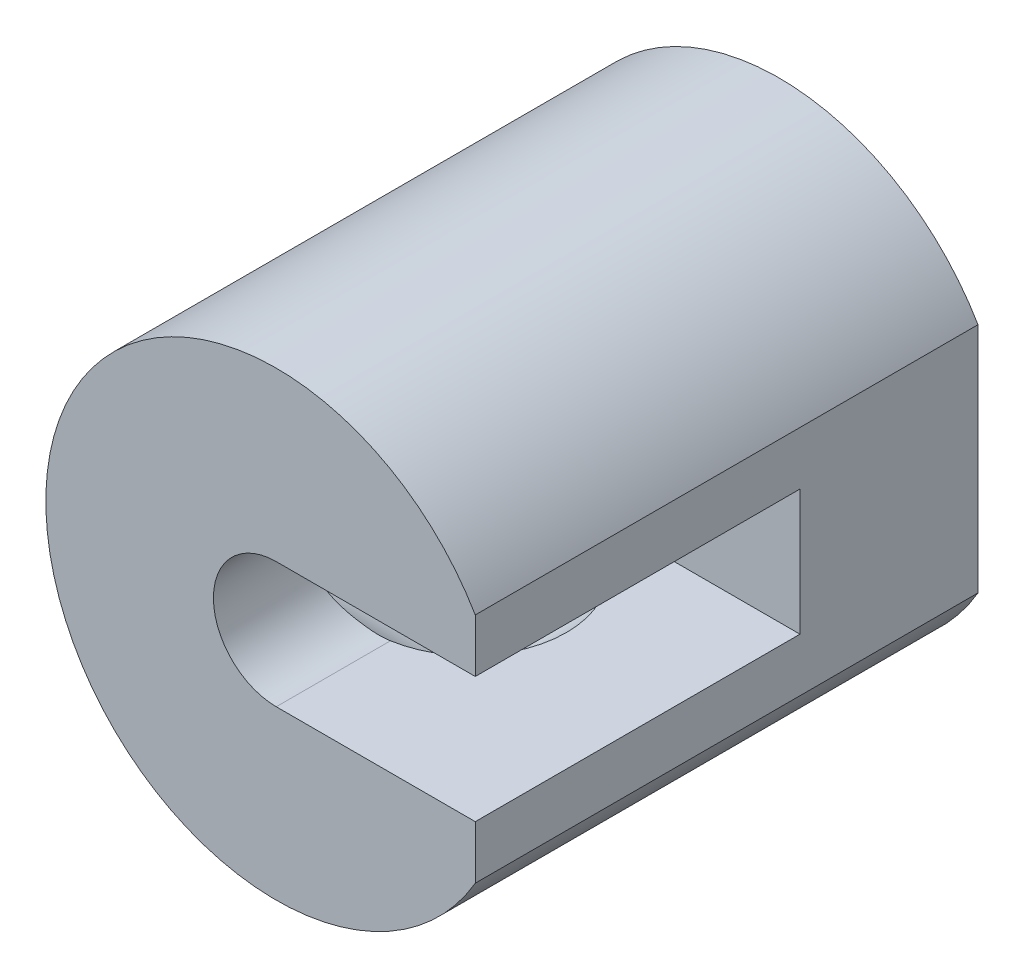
ISO-10303-21;
HEADER;
FILE_DESCRIPTION(('STEP AP214'),'2;1');
FILE_NAME('part.step','',(''),(''),'','','');
FILE_SCHEMA(('AUTOMOTIVE_DESIGN { 1 0 10303 214 1 1 1 1 }'));
ENDSEC;
DATA;
#1=APPLICATION_CONTEXT('core data for automotive mechanical design processes');
#2=APPLICATION_PROTOCOL_DEFINITION('international standard','automotive_design',2000,#1);
#3=PRODUCT_CONTEXT('',#1,'mechanical');
#4=PRODUCT('Part','Part','',(#3));
#5=PRODUCT_RELATED_PRODUCT_CATEGORY('part','',(#4));
#6=PRODUCT_DEFINITION_FORMATION('','',#4);
#7=PRODUCT_DEFINITION_CONTEXT('part definition',#1,'design');
#8=PRODUCT_DEFINITION('design','',#6,#7);
#9=PRODUCT_DEFINITION_SHAPE('','',#8);
#10=(LENGTH_UNIT() NAMED_UNIT(*) SI_UNIT(.MILLI.,.METRE.));
#11=(NAMED_UNIT(*) PLANE_ANGLE_UNIT() SI_UNIT($,.RADIAN.));
#12=(NAMED_UNIT(*) SI_UNIT($,.STERADIAN.) SOLID_ANGLE_UNIT());
#13=UNCERTAINTY_MEASURE_WITH_UNIT(LENGTH_MEASURE(1.E-05),#10,'distance_accuracy_value','');
#14=(GEOMETRIC_REPRESENTATION_CONTEXT(3) GLOBAL_UNCERTAINTY_ASSIGNED_CONTEXT((#13)) GLOBAL_UNIT_ASSIGNED_CONTEXT((#10,
#11,#12)) REPRESENTATION_CONTEXT('',''));
#15=CARTESIAN_POINT('',(0.,0.,0.));
#16=DIRECTION('',(0.,0.,1.));
#17=DIRECTION('',(1.,0.,0.));
#18=AXIS2_PLACEMENT_3D('',#15,#16,#17);
#19=CARTESIAN_POINT('',(4.74999999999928,0.,14.));
#20=DIRECTION('',(1.,0.,0.));
#21=DIRECTION('',(0.,1.,0.));
#22=AXIS2_PLACEMENT_3D('',#19,#20,#21);
#23=CYLINDRICAL_SURFACE('',#22,5.49999999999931);
#24=CARTESIAN_POINT('',(-9.52627944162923,5.49999999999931,14.));
#25=CARTESIAN_POINT('',(-9.52628026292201,5.49999938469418,13.856635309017));
#26=CARTESIAN_POINT('',(-9.52952683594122,5.49438702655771,13.7132581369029));
#27=CARTESIAN_POINT('',(-9.54239256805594,5.4720112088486,13.4276087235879));
#28=CARTESIAN_POINT('',(-9.55201469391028,5.45524255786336,13.2853370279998));
#29=CARTESIAN_POINT('',(-9.5772912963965,5.4107434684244,13.0028371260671));
#30=CARTESIAN_POINT('',(-9.59295523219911,5.38299583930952,12.8626124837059));
#31=CARTESIAN_POINT('',(-9.62975989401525,5.31687440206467,12.5853732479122));
#32=CARTESIAN_POINT('',(-9.65090300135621,5.27849597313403,12.4483600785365));
#33=CARTESIAN_POINT('',(-9.69782007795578,5.19179128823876,12.179239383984));
#34=CARTESIAN_POINT('',(-9.72356646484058,5.14352404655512,12.0471080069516));
#35=CARTESIAN_POINT('',(-9.77898767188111,5.03735912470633,11.7876047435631));
#36=CARTESIAN_POINT('',(-9.80866401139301,4.97945771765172,11.6602347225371));
#37=CARTESIAN_POINT('',(-9.90232154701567,4.79202654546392,11.2863099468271));
#38=CARTESIAN_POINT('',(-9.97097829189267,4.6486869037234,11.0476858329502));
#39=CARTESIAN_POINT('',(-10.1198329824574,4.31565962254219,10.5772818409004));
#40=CARTESIAN_POINT('',(-10.2005157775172,4.12312437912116,10.3476897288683));
#41=CARTESIAN_POINT('',(-10.3604667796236,3.70285774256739,9.92223888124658));
#42=CARTESIAN_POINT('',(-10.4397342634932,3.4751088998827,9.72639697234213));
#43=CARTESIAN_POINT('',(-10.5543291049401,3.10236472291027,9.45564941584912));
#44=CARTESIAN_POINT('',(-10.5929291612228,2.96821996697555,9.36689512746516));
#45=CARTESIAN_POINT('',(-10.6664816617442,2.69194359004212,9.20110887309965));
#46=CARTESIAN_POINT('',(-10.7014355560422,2.54981517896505,9.12407224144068));
#47=CARTESIAN_POINT('',(-10.7666847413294,2.25849127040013,8.98248603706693));
#48=CARTESIAN_POINT('',(-10.796981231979,2.10929760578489,8.91793324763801));
#49=CARTESIAN_POINT('',(-10.8520196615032,1.80487667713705,8.80202591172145));
#50=CARTESIAN_POINT('',(-10.8767621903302,1.64965005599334,8.75066996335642));
#51=CARTESIAN_POINT('',(-10.9183839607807,1.34563480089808,8.6649829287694));
#52=CARTESIAN_POINT('',(-10.9356972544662,1.19717331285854,8.62970087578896));
#53=CARTESIAN_POINT('',(-10.9643772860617,0.89728010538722,8.57153693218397));
#54=CARTESIAN_POINT('',(-10.9757446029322,0.745848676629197,8.54865383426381));
#55=CARTESIAN_POINT('',(-10.9921999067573,0.441338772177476,8.51559809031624));
#56=CARTESIAN_POINT('',(-10.9972909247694,0.288261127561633,8.50541930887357));
#57=CARTESIAN_POINT('',(-11.0010524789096,-0.0182842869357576,8.49789425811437));
#58=CARTESIAN_POINT('',(-10.9997234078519,-0.171752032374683,8.50054720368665));
#59=CARTESIAN_POINT('',(-10.9910819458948,-0.464373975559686,8.51785357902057));
#60=CARTESIAN_POINT('',(-10.9843017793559,-0.603608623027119,8.53143964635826));
#61=CARTESIAN_POINT('',(-10.9655930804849,-0.880344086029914,8.56911613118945));
#62=CARTESIAN_POINT('',(-10.9536629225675,-1.017844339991,8.59320986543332));
#63=CARTESIAN_POINT('',(-10.9249447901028,-1.29008212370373,8.65162972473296));
#64=CARTESIAN_POINT('',(-10.9081584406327,-1.42482056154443,8.68595242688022));
#65=CARTESIAN_POINT('',(-10.8701111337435,-1.69078120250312,8.76449660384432));
#66=CARTESIAN_POINT('',(-10.848848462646,-1.82200203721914,8.80872187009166));
#67=CARTESIAN_POINT('',(-10.802015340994,-2.08185496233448,8.90731470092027));
#68=CARTESIAN_POINT('',(-10.7763909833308,-2.21042880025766,8.96181023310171));
#69=CARTESIAN_POINT('',(-10.7216085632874,-2.46247345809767,9.08007827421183));
#70=CARTESIAN_POINT('',(-10.6924492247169,-2.58594241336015,9.14385413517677));
#71=CARTESIAN_POINT('',(-10.6005932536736,-2.94774083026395,9.34838977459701));
#72=CARTESIAN_POINT('',(-10.5334891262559,-3.17761932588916,9.50241788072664));
#73=CARTESIAN_POINT('',(-10.3864376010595,-3.63098933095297,9.85793205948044));
#74=CARTESIAN_POINT('',(-10.3058757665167,-3.85182303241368,10.0625279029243));
#75=CARTESIAN_POINT('',(-10.1449786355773,-4.25758842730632,10.5052822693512));
#76=CARTESIAN_POINT('',(-10.0646435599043,-4.44249249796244,10.7434663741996));
#77=CARTESIAN_POINT('',(-9.94829980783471,-4.69475077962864,11.1303134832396));
#78=CARTESIAN_POINT('',(-9.90912969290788,-4.77664146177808,11.2687561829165));
#79=CARTESIAN_POINT('',(-9.834566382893,-4.92832970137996,11.5530651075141));
#80=CARTESIAN_POINT('',(-9.79917159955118,-4.99813235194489,11.6989281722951));
#81=CARTESIAN_POINT('',(-9.73346692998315,-5.12491225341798,11.9971238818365));
#82=CARTESIAN_POINT('',(-9.70315396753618,-5.18189727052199,12.1494525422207));
#83=CARTESIAN_POINT('',(-9.64881329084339,-5.28239263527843,12.4595834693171));
#84=CARTESIAN_POINT('',(-9.62478471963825,-5.32590482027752,12.6173849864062));
#85=CARTESIAN_POINT('',(-9.58568788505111,-5.39593052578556,12.9244826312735));
#86=CARTESIAN_POINT('',(-9.57006086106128,-5.42351706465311,13.0734631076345));
#87=CARTESIAN_POINT('',(-9.54567038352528,-5.46633229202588,13.3737390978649));
#88=CARTESIAN_POINT('',(-9.53690608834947,-5.48156249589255,13.5250343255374));
#89=CARTESIAN_POINT('',(-9.52661622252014,-5.49942639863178,13.8285270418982));
#90=CARTESIAN_POINT('',(-9.52508651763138,-5.50206729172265,13.9807239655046));
#91=CARTESIAN_POINT('',(-9.52932114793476,-5.49472990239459,14.2847029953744));
#92=CARTESIAN_POINT('',(-9.53508499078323,-5.48475247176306,14.4364851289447));
#93=CARTESIAN_POINT('',(-9.55263655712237,-5.45411820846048,14.721696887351));
#94=CARTESIAN_POINT('',(-9.56369369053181,-5.43475369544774,14.8553123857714));
#95=CARTESIAN_POINT('',(-9.59101548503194,-5.38638840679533,15.1202593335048));
#96=CARTESIAN_POINT('',(-9.60728175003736,-5.35738466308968,15.2515900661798));
#97=CARTESIAN_POINT('',(-9.6631656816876,-5.25635327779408,15.6408810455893));
#98=CARTESIAN_POINT('',(-9.70988100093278,-5.17028506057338,15.8943257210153));
#99=CARTESIAN_POINT('',(-9.81949365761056,-4.95905569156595,16.3948025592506));
#100=CARTESIAN_POINT('',(-9.88304025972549,-4.83226856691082,16.6409940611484));
#101=CARTESIAN_POINT('',(-10.0185866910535,-4.54457763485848,17.110071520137));
#102=CARTESIAN_POINT('',(-10.0905908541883,-4.38365630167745,17.33294541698));
#103=CARTESIAN_POINT('',(-10.245837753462,-4.00861671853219,17.7783805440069));
#104=CARTESIAN_POINT('',(-10.3293530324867,-3.79034975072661,17.9973609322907));
#105=CARTESIAN_POINT('',(-10.4903919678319,-3.31867395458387,18.3967907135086));
#106=CARTESIAN_POINT('',(-10.5679135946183,-3.06525330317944,18.5772270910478));
#107=CARTESIAN_POINT('',(-10.6746136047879,-2.65951482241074,18.8169104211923));
#108=CARTESIAN_POINT('',(-10.7089721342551,-2.51794147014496,18.8924283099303));
#109=CARTESIAN_POINT('',(-10.7730448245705,-2.22789327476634,19.0311321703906));
#110=CARTESIAN_POINT('',(-10.8027610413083,-2.07942152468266,19.0943236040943));
#111=CARTESIAN_POINT('',(-10.856658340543,-1.77668429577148,19.2076396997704));
#112=CARTESIAN_POINT('',(-10.8808420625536,-1.62242162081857,19.257770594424));
#113=CARTESIAN_POINT('',(-10.9229459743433,-1.30927195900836,19.3443599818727));
#114=CARTESIAN_POINT('',(-10.9408669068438,-1.15038552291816,19.3808200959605));
#115=CARTESIAN_POINT('',(-10.968539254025,-0.844141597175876,19.4368545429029));
#116=CARTESIAN_POINT('',(-10.9788895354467,-0.697064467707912,19.457671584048));
#117=CARTESIAN_POINT('',(-10.9936692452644,-0.401416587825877,19.4873427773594));
#118=CARTESIAN_POINT('',(-10.9980991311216,-0.252845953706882,19.496197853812));
#119=CARTESIAN_POINT('',(-11.0009146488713,0.0445367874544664,19.5018295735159));
#120=CARTESIAN_POINT('',(-10.9993020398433,0.193348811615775,19.4986097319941));
#121=CARTESIAN_POINT('',(-10.9900814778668,0.490034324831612,19.4801419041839));
#122=CARTESIAN_POINT('',(-10.9824736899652,0.637907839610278,19.4648942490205));
#123=CARTESIAN_POINT('',(-10.9621702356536,0.921802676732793,19.423971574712));
#124=CARTESIAN_POINT('',(-10.9498446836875,1.0579606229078,19.3990535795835));
#125=CARTESIAN_POINT('',(-10.9204381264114,1.32756443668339,19.3391618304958));
#126=CARTESIAN_POINT('',(-10.9033556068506,1.4610094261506,19.3041848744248));
#127=CARTESIAN_POINT('',(-10.8648296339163,1.72428668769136,19.2245324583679));
#128=CARTESIAN_POINT('',(-10.8433873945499,1.85411995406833,19.1798596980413));
#129=CARTESIAN_POINT('',(-10.7966150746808,2.10950126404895,19.081217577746));
#130=CARTESIAN_POINT('',(-10.7712835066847,2.23504764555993,19.027244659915));
#131=CARTESIAN_POINT('',(-10.6879472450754,2.61467971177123,18.8470568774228));
#132=CARTESIAN_POINT('',(-10.6242802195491,2.86064690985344,18.7059314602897));
#133=CARTESIAN_POINT('',(-10.4878410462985,3.32630192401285,18.3892136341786));
#134=CARTESIAN_POINT('',(-10.4150647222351,3.54597759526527,18.2136053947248));
#135=CARTESIAN_POINT('',(-10.2590780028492,3.97600893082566,17.8126325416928));
#136=CARTESIAN_POINT('',(-10.1755500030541,4.18326133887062,17.5840554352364));
#137=CARTESIAN_POINT('',(-10.0134581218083,4.55767402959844,17.0939718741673));
#138=CARTESIAN_POINT('',(-9.93489867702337,4.72479884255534,16.8324365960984));
#139=CARTESIAN_POINT('',(-9.82675425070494,4.94386827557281,16.415358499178));
#140=CARTESIAN_POINT('',(-9.791855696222,5.01243240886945,16.2697110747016));
#141=CARTESIAN_POINT('',(-9.72716768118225,5.13683980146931,15.9720189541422));
#142=CARTESIAN_POINT('',(-9.69737559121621,5.19268961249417,15.8199776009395));
#143=CARTESIAN_POINT('',(-9.64416228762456,5.29086476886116,15.5109513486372));
#144=CARTESIAN_POINT('',(-9.6207247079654,5.33322490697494,15.353980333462));
#145=CARTESIAN_POINT('',(-9.58116263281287,5.40397782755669,15.0360986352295));
#146=CARTESIAN_POINT('',(-9.56503302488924,5.43238037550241,14.8751907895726));
#147=CARTESIAN_POINT('',(-9.54412294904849,5.46900539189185,14.5951023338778));
#148=CARTESIAN_POINT('',(-9.53744790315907,5.48061724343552,14.476493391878));
#149=CARTESIAN_POINT('',(-9.52852565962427,5.49611506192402,14.2385925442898));
#150=CARTESIAN_POINT('',(-9.52627875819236,5.50000051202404,14.1193005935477));
#151=CARTESIAN_POINT('',(-9.52627944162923,5.49999999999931,14.));
#152=B_SPLINE_CURVE_WITH_KNOTS('',3,(#24,#25,#26,#27,#28,#29,#30,#31,#32,#33,#34,#35,#36,#37,
#38,#39,#40,#41,#42,#43,#44,#45,#46,#47,#48,#49,#50,#51,#52,#53,#54,#55,#56,#57,#58,#59,#60,#61,
#62,#63,#64,#65,#66,#67,#68,#69,#70,#71,#72,#73,#74,#75,#76,#77,#78,#79,#80,#81,#82,#83,#84,#85,
#86,#87,#88,#89,#90,#91,#92,#93,#94,#95,#96,#97,#98,#99,#100,#101,#102,#103,#104,#105,#106,#107,
#108,#109,#110,#111,#112,#113,#114,#115,#116,#117,#118,#119,#120,#121,#122,#123,#124,#125,#126,
#127,#128,#129,#130,#131,#132,#133,#134,#135,#136,#137,#138,#139,#140,#141,#142,#143,#144,#145,
#146,#147,#148,#149,#150,#151),.UNSPECIFIED.,.T.,.F.,(4,2,2,2,2,2,2,2,2,2,2,2,2,2,2,2,2,2,2,2,2,
2,2,2,2,2,2,2,2,2,2,2,2,2,2,2,2,2,2,2,2,2,2,2,2,2,2,2,2,2,2,2,2,2,2,2,2,2,2,2,2,2,2,4),(0.,
0.42997062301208,0.860141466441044,1.29098854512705,1.72202319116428,2.15055676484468,
2.57925649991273,3.43584921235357,4.36309194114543,5.29079563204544,5.78649985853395,
6.28200618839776,6.77738467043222,7.27271050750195,7.73281286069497,8.1928704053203,
8.6527056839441,9.11251282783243,9.53219720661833,9.95201415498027,10.3716907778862,
10.7915283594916,11.2169918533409,11.6426094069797,12.4933364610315,13.4244805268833,
14.3563376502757,14.8524480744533,15.3483489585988,15.8439485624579,16.3394805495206,
16.7957830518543,17.2520295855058,17.7080153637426,18.1639703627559,18.5698815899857,
18.9759179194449,19.7874357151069,20.6365391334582,21.4860795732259,22.4427087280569,
23.3996604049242,23.8913787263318,24.3828786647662,24.8741436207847,25.3653502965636,
25.8114713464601,26.2575579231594,26.7035146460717,27.1494590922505,27.565885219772,
27.9824440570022,28.3988870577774,28.8154897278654,29.6834896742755,30.5518890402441,
31.5067116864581,32.4623752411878,32.9559555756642,33.4492809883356,33.9413235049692,
34.4330212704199,34.7907963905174,35.1485954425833),.UNSPECIFIED.);
#153=CARTESIAN_POINT('',(-9.52627944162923,5.49999999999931,14.));
#154=VERTEX_POINT('',#153);
#155=EDGE_CURVE('E181',#154,#154,#152,.T.);
#156=ORIENTED_EDGE('',*,*,#155,.T.);
#157=EDGE_LOOP('',(#156));
#158=FACE_BOUND('',#157,.T.);
#159=CARTESIAN_POINT('',(-0.750000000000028,-5.34438958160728,12.7009618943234));
#160=CARTESIAN_POINT('',(-0.786837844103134,-5.34955827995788,12.7222314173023));
#161=CARTESIAN_POINT('',(-0.822726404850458,-5.35496910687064,12.7450409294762));
#162=CARTESIAN_POINT('',(-0.892403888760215,-5.36611628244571,12.7935919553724));
#163=CARTESIAN_POINT('',(-0.926193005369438,-5.37185260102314,12.8193331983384));
#164=CARTESIAN_POINT('',(-1.02406798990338,-5.38930405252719,12.9006960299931));
#165=CARTESIAN_POINT('',(-1.08472035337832,-5.40127035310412,12.9604908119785));
#166=CARTESIAN_POINT('',(-1.19510597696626,-5.42451405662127,13.089536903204));
#167=CARTESIAN_POINT('',(-1.24483501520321,-5.43579119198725,13.1587918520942));
#168=CARTESIAN_POINT('',(-1.33195091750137,-5.45639985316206,13.3049222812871));
#169=CARTESIAN_POINT('',(-1.36934296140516,-5.46573219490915,13.3817945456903));
#170=CARTESIAN_POINT('',(-1.43032323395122,-5.48132817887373,13.5403048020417));
#171=CARTESIAN_POINT('',(-1.45403650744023,-5.48761953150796,13.6218918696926));
#172=CARTESIAN_POINT('',(-1.4873729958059,-5.49654588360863,13.7880995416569));
#173=CARTESIAN_POINT('',(-1.49699705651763,-5.49918110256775,13.8727199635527));
#174=CARTESIAN_POINT('',(-1.50172500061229,-5.5004704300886,14.0396831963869));
#175=CARTESIAN_POINT('',(-1.49728232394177,-5.49924886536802,14.1220125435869));
#176=CARTESIAN_POINT('',(-1.47502175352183,-5.4932299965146,14.2846918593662));
#177=CARTESIAN_POINT('',(-1.45720594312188,-5.48843324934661,14.3650421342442));
#178=CARTESIAN_POINT('',(-1.40893091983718,-5.4758150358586,14.5211066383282));
#179=CARTESIAN_POINT('',(-1.37854023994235,-5.46800998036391,14.5968434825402));
#180=CARTESIAN_POINT('',(-1.30602217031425,-5.45018013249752,14.7422325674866));
#181=CARTESIAN_POINT('',(-1.26388792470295,-5.44015404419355,14.811881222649));
#182=CARTESIAN_POINT('',(-1.16765122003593,-5.41859269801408,14.9452822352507));
#183=CARTESIAN_POINT('',(-1.11323223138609,-5.40702163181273,15.008799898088));
#184=CARTESIAN_POINT('',(-0.994664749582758,-5.38386478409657,15.1258594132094));
#185=CARTESIAN_POINT('',(-0.930532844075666,-5.372279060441,15.1794179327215));
#186=CARTESIAN_POINT('',(-0.844233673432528,-5.35839580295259,15.2400673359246));
#187=CARTESIAN_POINT('',(-0.825749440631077,-5.35551280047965,15.252451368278));
#188=CARTESIAN_POINT('',(-0.788263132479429,-5.34986139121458,15.2763751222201));
#189=CARTESIAN_POINT('',(-0.769261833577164,-5.34709282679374,15.287916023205));
#190=CARTESIAN_POINT('',(-0.750000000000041,-5.34438958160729,15.2990381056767));
#191=B_SPLINE_CURVE_WITH_KNOTS('',3,(#159,#160,#161,#162,#163,#164,#165,#166,#167,#168,#169,
#170,#171,#172,#173,#174,#175,#176,#177,#178,#179,#180,#181,#182,#183,#184,#185,#186,#187,#188,
#189,#190),.UNSPECIFIED.,.F.,.F.,(4,2,2,2,2,2,2,2,2,2,2,2,2,2,2,4),(0.,0.128468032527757,
0.256924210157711,0.513633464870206,0.770441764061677,1.02714210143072,1.28145701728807,
1.53575666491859,1.78194342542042,2.02809184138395,2.27291605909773,2.51788350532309,
2.77008096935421,3.02185249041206,3.08914445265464,3.15634040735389),.UNSPECIFIED.);
#192=CARTESIAN_POINT('',(-0.750000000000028,-5.34438958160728,12.7009618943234));
#193=VERTEX_POINT('',#192);
#194=CARTESIAN_POINT('',(-0.750000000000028,-5.34438958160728,15.2990381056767));
#195=VERTEX_POINT('',#194);
#196=EDGE_CURVE('E34',#193,#195,#191,.T.);
#197=ORIENTED_EDGE('',*,*,#196,.F.);
#198=CARTESIAN_POINT('',(-0.750000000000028,0.,14.));
#199=DIRECTION('',(1.,0.,0.));
#200=DIRECTION('',(0.,1.,0.));
#201=AXIS2_PLACEMENT_3D('',#198,#199,#200);
#202=CIRCLE('',#201,5.49999999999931);
#203=CARTESIAN_POINT('',(-0.750000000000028,-2.90473750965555,9.32961457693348));
#204=VERTEX_POINT('',#203);
#205=EDGE_CURVE('E125',#193,#204,#202,.T.);
#206=ORIENTED_EDGE('',*,*,#205,.T.);
#207=CARTESIAN_POINT('',(0.,3.,9.3902277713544));
#208=CARTESIAN_POINT('',(-0.0774130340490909,3.00001533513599,9.39025457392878));
#209=CARTESIAN_POINT('',(-0.154810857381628,2.99700418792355,9.38827844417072));
#210=CARTESIAN_POINT('',(-0.308898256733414,2.98505013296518,9.38052303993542));
#211=CARTESIAN_POINT('',(-0.38558832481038,2.97611171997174,9.37474664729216));
#212=CARTESIAN_POINT('',(-0.537192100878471,2.95250333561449,9.35964362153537));
#213=CARTESIAN_POINT('',(-0.61211426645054,2.93787215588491,9.35034102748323));
#214=CARTESIAN_POINT('',(-0.760179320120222,2.90308755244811,9.32854371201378));
#215=CARTESIAN_POINT('',(-0.833321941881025,2.88293330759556,9.31604851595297));
#216=CARTESIAN_POINT('',(-1.04898301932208,2.81465616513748,9.2744779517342));
#217=CARTESIAN_POINT('',(-1.18828662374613,2.75863074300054,9.24125748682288));
#218=CARTESIAN_POINT('',(-1.45562096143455,2.62743952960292,9.167587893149));
#219=CARTESIAN_POINT('',(-1.58363012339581,2.55223813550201,9.12712536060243));
#220=CARTESIAN_POINT('',(-1.83847719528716,2.37618853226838,9.03871512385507));
#221=CARTESIAN_POINT('',(-1.96395744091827,2.27354360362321,8.99042271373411));
#222=CARTESIAN_POINT('',(-2.19697602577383,2.04926019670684,8.89457025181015));
#223=CARTESIAN_POINT('',(-2.30450880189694,1.92761585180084,8.84701043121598));
#224=CARTESIAN_POINT('',(-2.50753678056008,1.65629264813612,8.75319490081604));
#225=CARTESIAN_POINT('',(-2.60125674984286,1.50511587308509,8.70738596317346));
#226=CARTESIAN_POINT('',(-2.76129845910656,1.18616666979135,8.62692144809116));
#227=CARTESIAN_POINT('',(-2.82764017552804,1.01840645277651,8.59225774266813));
#228=CARTESIAN_POINT('',(-2.92531338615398,0.685631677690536,8.54052269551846));
#229=CARTESIAN_POINT('',(-2.95907174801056,0.52152216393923,8.52224081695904));
#230=CARTESIAN_POINT('',(-2.99870513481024,0.189037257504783,8.50073292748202));
#231=CARTESIAN_POINT('',(-3.00460049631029,0.0206650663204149,8.4974959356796));
#232=CARTESIAN_POINT('',(-2.98906013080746,-0.296927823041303,8.50596088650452));
#233=CARTESIAN_POINT('',(-2.9703777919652,-0.446334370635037,8.51615800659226));
#234=CARTESIAN_POINT('',(-2.91127168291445,-0.739498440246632,8.54794694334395));
#235=CARTESIAN_POINT('',(-2.87084661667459,-0.883255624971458,8.56953943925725));
#236=CARTESIAN_POINT('',(-2.76937545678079,-1.16317983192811,8.62249567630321));
#237=CARTESIAN_POINT('',(-2.70810489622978,-1.29924458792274,8.65396547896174));
#238=CARTESIAN_POINT('',(-2.567115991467,-1.55943423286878,8.72398408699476));
#239=CARTESIAN_POINT('',(-2.48739159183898,-1.68355518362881,8.76253521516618));
#240=CARTESIAN_POINT('',(-2.30207312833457,-1.93048307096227,8.84809997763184));
#241=CARTESIAN_POINT('',(-2.194627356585,-2.05173961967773,8.895577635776));
#242=CARTESIAN_POINT('',(-1.9617478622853,-2.2754471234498,8.99128956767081));
#243=CARTESIAN_POINT('',(-1.83629271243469,-2.37787534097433,9.0395246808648));
#244=CARTESIAN_POINT('',(-1.55794877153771,-2.56978270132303,9.13597749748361));
#245=CARTESIAN_POINT('',(-1.40362710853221,-2.6573830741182,9.18383489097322));
#246=CARTESIAN_POINT('',(-1.07958660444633,-2.80463582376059,9.26805801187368));
#247=CARTESIAN_POINT('',(-0.909913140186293,-2.86436754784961,9.30445626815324));
#248=CARTESIAN_POINT('',(-0.616057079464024,-2.93862688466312,9.35072986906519));
#249=CARTESIAN_POINT('',(-0.494714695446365,-2.96150578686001,9.36536652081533));
#250=CARTESIAN_POINT('',(-0.310540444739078,-2.98452986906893,9.38018838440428));
#251=CARTESIAN_POINT('',(-0.248660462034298,-2.99032238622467,9.38394047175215));
#252=CARTESIAN_POINT('',(-0.124526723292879,-2.99806064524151,9.38896525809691));
#253=CARTESIAN_POINT('',(-0.0622727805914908,-3.00000427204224,9.39023659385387));
#254=CARTESIAN_POINT('',(0.,-3.,9.3902277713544));
#255=B_SPLINE_CURVE_WITH_KNOTS('',3,(#207,#208,#209,#210,#211,#212,#213,#214,#215,#216,#217,
#218,#219,#220,#221,#222,#223,#224,#225,#226,#227,#228,#229,#230,#231,#232,#233,#234,#235,#236,
#237,#238,#239,#240,#241,#242,#243,#244,#245,#246,#247,#248,#249,#250,#251,#252,#253,#254),
.UNSPECIFIED.,.F.,.F.,(4,2,2,2,2,2,2,2,2,2,2,2,2,2,2,2,2,2,2,2,2,2,2,4),(0.,0.232130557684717,
0.464085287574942,0.694486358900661,0.924921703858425,1.38412724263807,1.84419164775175,
2.34957795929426,2.85512063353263,3.40321827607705,3.95091529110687,4.45365322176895,
4.95602415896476,5.40663492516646,5.85727255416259,6.3129249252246,6.76872702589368,
7.27311530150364,7.77810874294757,8.32665691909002,8.87363359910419,9.24538092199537,
9.4320176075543,9.61875682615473),.UNSPECIFIED.);
#256=CARTESIAN_POINT('',(-3.,0.,8.5000000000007));
#257=VERTEX_POINT('',#256);
#258=EDGE_CURVE('E132',#257,#204,#255,.T.);
#259=ORIENTED_EDGE('',*,*,#258,.F.);
#260=CARTESIAN_POINT('',(-0.750000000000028,2.90473750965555,9.32961457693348));
#261=VERTEX_POINT('',#260);
#262=EDGE_CURVE('E149',#261,#257,#255,.T.);
#263=ORIENTED_EDGE('',*,*,#262,.F.);
#264=CARTESIAN_POINT('',(-0.750000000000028,5.34438958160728,12.7009618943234));
#265=VERTEX_POINT('',#264);
#266=EDGE_CURVE('E116',#261,#265,#202,.T.);
#267=ORIENTED_EDGE('',*,*,#266,.T.);
#268=CARTESIAN_POINT('',(-0.750000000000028,5.34438958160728,15.2990381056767));
#269=CARTESIAN_POINT('',(-0.786837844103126,5.34955827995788,15.2777685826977));
#270=CARTESIAN_POINT('',(-0.822726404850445,5.35496910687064,15.2549590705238));
#271=CARTESIAN_POINT('',(-0.892403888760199,5.36611628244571,15.2064080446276));
#272=CARTESIAN_POINT('',(-0.926193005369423,5.37185260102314,15.1806668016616));
#273=CARTESIAN_POINT('',(-1.02406798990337,5.38930405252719,15.0993039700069));
#274=CARTESIAN_POINT('',(-1.08472035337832,5.40127035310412,15.0395091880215));
#275=CARTESIAN_POINT('',(-1.19510597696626,5.42451405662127,14.910463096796));
#276=CARTESIAN_POINT('',(-1.2448350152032,5.43579119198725,14.8412081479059));
#277=CARTESIAN_POINT('',(-1.33195091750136,5.45639985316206,14.6950777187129));
#278=CARTESIAN_POINT('',(-1.36934296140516,5.46573219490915,14.6182054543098));
#279=CARTESIAN_POINT('',(-1.43032323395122,5.48132817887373,14.4596951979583));
#280=CARTESIAN_POINT('',(-1.45403650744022,5.48761953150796,14.3781081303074));
#281=CARTESIAN_POINT('',(-1.48737299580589,5.49654588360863,14.2119004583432));
#282=CARTESIAN_POINT('',(-1.49699705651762,5.49918110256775,14.1272800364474));
#283=CARTESIAN_POINT('',(-1.50172500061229,5.5004704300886,13.9603168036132));
#284=CARTESIAN_POINT('',(-1.49728232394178,5.49924886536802,13.8779874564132));
#285=CARTESIAN_POINT('',(-1.47502175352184,5.4932299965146,13.7153081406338));
#286=CARTESIAN_POINT('',(-1.45720594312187,5.48843324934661,13.6349578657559));
#287=CARTESIAN_POINT('',(-1.40893091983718,5.4758150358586,13.4788933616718));
#288=CARTESIAN_POINT('',(-1.37854023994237,5.46800998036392,13.4031565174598));
#289=CARTESIAN_POINT('',(-1.30602217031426,5.45018013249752,13.2577674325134));
#290=CARTESIAN_POINT('',(-1.26388792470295,5.44015404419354,13.188118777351));
#291=CARTESIAN_POINT('',(-1.16765122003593,5.41859269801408,13.0547177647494));
#292=CARTESIAN_POINT('',(-1.11323223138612,5.40702163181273,12.991200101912));
#293=CARTESIAN_POINT('',(-0.994664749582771,5.38386478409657,12.8741405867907));
#294=CARTESIAN_POINT('',(-0.930532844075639,5.37227906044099,12.8205820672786));
#295=CARTESIAN_POINT('',(-0.844233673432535,5.35839580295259,12.7599326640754));
#296=CARTESIAN_POINT('',(-0.825749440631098,5.35551280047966,12.7475486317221));
#297=CARTESIAN_POINT('',(-0.788263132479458,5.34986139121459,12.7236248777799));
#298=CARTESIAN_POINT('',(-0.769261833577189,5.34709282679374,12.712083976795));
#299=CARTESIAN_POINT('',(-0.750000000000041,5.34438958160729,12.7009618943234));
#300=B_SPLINE_CURVE_WITH_KNOTS('',3,(#268,#269,#270,#271,#272,#273,#274,#275,#276,#277,#278,
#279,#280,#281,#282,#283,#284,#285,#286,#287,#288,#289,#290,#291,#292,#293,#294,#295,#296,#297,
#298,#299),.UNSPECIFIED.,.F.,.F.,(4,2,2,2,2,2,2,2,2,2,2,2,2,2,2,4),(0.,0.128468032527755,
0.256924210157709,0.513633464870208,0.770441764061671,1.02714210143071,1.28145701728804,
1.53575666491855,1.7819434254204,2.02809184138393,2.27291605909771,2.51788350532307,
2.7700809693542,3.02185249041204,3.08914445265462,3.15634040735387),.UNSPECIFIED.);
#301=CARTESIAN_POINT('',(-0.750000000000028,5.34438958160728,15.2990381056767));
#302=VERTEX_POINT('',#301);
#303=EDGE_CURVE('E41',#302,#265,#300,.T.);
#304=ORIENTED_EDGE('',*,*,#303,.F.);
#305=CARTESIAN_POINT('',(-0.750000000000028,2.90473750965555,18.6703854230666));
#306=VERTEX_POINT('',#305);
#307=EDGE_CURVE('E114',#302,#306,#202,.T.);
#308=ORIENTED_EDGE('',*,*,#307,.T.);
#309=CARTESIAN_POINT('',(0.,-3.,18.6097722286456));
#310=CARTESIAN_POINT('',(-0.077413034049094,-3.00001533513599,18.6097454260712));
#311=CARTESIAN_POINT('',(-0.154810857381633,-2.99700418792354,18.6117215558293));
#312=CARTESIAN_POINT('',(-0.308898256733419,-2.98505013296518,18.6194769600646));
#313=CARTESIAN_POINT('',(-0.385588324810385,-2.97611171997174,18.6252533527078));
#314=CARTESIAN_POINT('',(-0.537192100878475,-2.95250333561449,18.6403563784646));
#315=CARTESIAN_POINT('',(-0.612114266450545,-2.93787215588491,18.6496589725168));
#316=CARTESIAN_POINT('',(-0.760179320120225,-2.9030875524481,18.6714562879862));
#317=CARTESIAN_POINT('',(-0.833321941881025,-2.88293330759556,18.6839514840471));
#318=CARTESIAN_POINT('',(-1.04898301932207,-2.81465616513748,18.7255220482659));
#319=CARTESIAN_POINT('',(-1.18828662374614,-2.75863074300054,18.7587425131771));
#320=CARTESIAN_POINT('',(-1.45562096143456,-2.62743952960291,18.832412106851));
#321=CARTESIAN_POINT('',(-1.58363012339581,-2.55223813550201,18.8728746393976));
#322=CARTESIAN_POINT('',(-1.83847719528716,-2.37618853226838,18.961284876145));
#323=CARTESIAN_POINT('',(-1.96395744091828,-2.2735436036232,19.0095772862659));
#324=CARTESIAN_POINT('',(-2.19697602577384,-2.04926019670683,19.1054297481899));
#325=CARTESIAN_POINT('',(-2.30450880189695,-1.92761585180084,19.1529895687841));
#326=CARTESIAN_POINT('',(-2.50753678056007,-1.65629264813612,19.246805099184));
#327=CARTESIAN_POINT('',(-2.60125674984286,-1.50511587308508,19.2926140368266));
#328=CARTESIAN_POINT('',(-2.76129845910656,-1.18616666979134,19.3730785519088));
#329=CARTESIAN_POINT('',(-2.82764017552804,-1.01840645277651,19.4077422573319));
#330=CARTESIAN_POINT('',(-2.92531338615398,-0.685631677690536,19.4594773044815));
#331=CARTESIAN_POINT('',(-2.95907174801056,-0.521522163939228,19.477759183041));
#332=CARTESIAN_POINT('',(-2.99870513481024,-0.189037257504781,19.499267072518));
#333=CARTESIAN_POINT('',(-3.00460049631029,-0.0206650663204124,19.5025040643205));
#334=CARTESIAN_POINT('',(-2.98906013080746,0.2969278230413,19.4940391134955));
#335=CARTESIAN_POINT('',(-2.9703777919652,0.446334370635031,19.4838419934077));
#336=CARTESIAN_POINT('',(-2.91127168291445,0.739498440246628,19.452053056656));
#337=CARTESIAN_POINT('',(-2.87084661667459,0.883255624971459,19.4304605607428));
#338=CARTESIAN_POINT('',(-2.76937545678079,1.16317983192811,19.3775043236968));
#339=CARTESIAN_POINT('',(-2.70810489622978,1.29924458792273,19.3460345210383));
#340=CARTESIAN_POINT('',(-2.567115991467,1.55943423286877,19.2760159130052));
#341=CARTESIAN_POINT('',(-2.48739159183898,1.68355518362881,19.2374647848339));
#342=CARTESIAN_POINT('',(-2.30207312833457,1.93048307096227,19.1519000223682));
#343=CARTESIAN_POINT('',(-2.19462735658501,2.05173961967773,19.104422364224));
#344=CARTESIAN_POINT('',(-1.96174786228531,2.27544712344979,19.0087104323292));
#345=CARTESIAN_POINT('',(-1.83629271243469,2.37787534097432,18.9604753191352));
#346=CARTESIAN_POINT('',(-1.55794877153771,2.56978270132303,18.8640225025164));
#347=CARTESIAN_POINT('',(-1.40362710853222,2.6573830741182,18.8161651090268));
#348=CARTESIAN_POINT('',(-1.07958660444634,2.80463582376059,18.7319419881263));
#349=CARTESIAN_POINT('',(-0.909913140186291,2.86436754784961,18.6955437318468));
#350=CARTESIAN_POINT('',(-0.616057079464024,2.93862688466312,18.6492701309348));
#351=CARTESIAN_POINT('',(-0.494714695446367,2.96150578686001,18.6346334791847));
#352=CARTESIAN_POINT('',(-0.31054044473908,2.98452986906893,18.6198116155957));
#353=CARTESIAN_POINT('',(-0.248660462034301,2.99032238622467,18.6160595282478));
#354=CARTESIAN_POINT('',(-0.12452672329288,2.99806064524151,18.6110347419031));
#355=CARTESIAN_POINT('',(-0.0622727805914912,3.00000427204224,18.6097634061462));
#356=CARTESIAN_POINT('',(0.,3.,18.6097722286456));
#357=B_SPLINE_CURVE_WITH_KNOTS('',3,(#309,#310,#311,#312,#313,#314,#315,#316,#317,#318,#319,
#320,#321,#322,#323,#324,#325,#326,#327,#328,#329,#330,#331,#332,#333,#334,#335,#336,#337,#338,
#339,#340,#341,#342,#343,#344,#345,#346,#347,#348,#349,#350,#351,#352,#353,#354,#355,#356),
.UNSPECIFIED.,.F.,.F.,(4,2,2,2,2,2,2,2,2,2,2,2,2,2,2,2,2,2,2,2,2,2,2,4),(0.,0.232130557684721,
0.464085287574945,0.694486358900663,0.92492170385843,1.38412724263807,1.84419164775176,
2.34957795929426,2.85512063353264,3.40321827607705,3.95091529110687,4.45365322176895,
4.95602415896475,5.40663492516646,5.85727255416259,6.31292492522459,6.76872702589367,
7.27311530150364,7.77810874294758,8.32665691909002,8.87363359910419,9.24538092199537,
9.4320176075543,9.61875682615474),.UNSPECIFIED.);
#358=CARTESIAN_POINT('',(-0.750000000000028,-2.90473750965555,18.6703854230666));
#359=VERTEX_POINT('',#358);
#360=EDGE_CURVE('E28',#359,#306,#357,.T.);
#361=ORIENTED_EDGE('',*,*,#360,.F.);
#362=EDGE_CURVE('E124',#359,#195,#202,.T.);
#363=ORIENTED_EDGE('',*,*,#362,.T.);
#364=EDGE_LOOP('',(#197,#206,#259,#263,#267,#304,#308,#361,#363));
#365=FACE_BOUND('',#364,.T.);
#366=ADVANCED_FACE('F14',(#158,#365),#23,.F.);
#367=CARTESIAN_POINT('',(-0.750000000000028,0.,14.));
#368=DIRECTION('',(0.,-1.,0.));
#369=DIRECTION('',(0.,0.,1.));
#370=AXIS2_PLACEMENT_3D('',#367,#368,#369);
#371=SPHERICAL_SURFACE('',#370,5.49999999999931);
#372=ORIENTED_EDGE('',*,*,#205,.F.);
#373=CARTESIAN_POINT('',(-0.750200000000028,-5.34441764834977,12.7010773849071));
#374=CARTESIAN_POINT('',(-0.713293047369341,-5.33923839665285,12.6797619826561));
#375=CARTESIAN_POINT('',(-0.675509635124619,-5.33392855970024,12.660038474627));
#376=CARTESIAN_POINT('',(-0.598433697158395,-5.3230799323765,12.6238856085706));
#377=CARTESIAN_POINT('',(-0.559141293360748,-5.31754116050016,12.6074559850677));
#378=CARTESIAN_POINT('',(-0.439493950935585,-5.30064779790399,12.5633191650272));
#379=CARTESIAN_POINT('',(-0.357240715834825,-5.28899818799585,12.5406902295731));
#380=CARTESIAN_POINT('',(-0.190173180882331,-5.26525411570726,12.5096762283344));
#381=CARTESIAN_POINT('',(-0.105358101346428,-5.25315951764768,12.5012955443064));
#382=CARTESIAN_POINT('',(0.0644526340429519,-5.22885920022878,12.4989833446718));
#383=CARTESIAN_POINT('',(0.149448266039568,-5.21665349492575,12.5050500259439));
#384=CARTESIAN_POINT('',(0.317481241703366,-5.19243923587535,12.5315099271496));
#385=CARTESIAN_POINT('',(0.400511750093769,-5.18043140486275,12.5519472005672));
#386=CARTESIAN_POINT('',(0.561989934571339,-5.1570003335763,12.6066463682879));
#387=CARTESIAN_POINT('',(0.640437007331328,-5.1455771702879,12.6409100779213));
#388=CARTESIAN_POINT('',(0.7903142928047,-5.12368502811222,12.7222450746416));
#389=CARTESIAN_POINT('',(0.86175899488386,-5.11321408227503,12.7692891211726));
#390=CARTESIAN_POINT('',(0.995727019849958,-5.09352594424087,12.8749210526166));
#391=CARTESIAN_POINT('',(1.05825118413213,-5.08430863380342,12.9335078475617));
#392=CARTESIAN_POINT('',(1.17206017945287,-5.06749248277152,13.0600745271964));
#393=CARTESIAN_POINT('',(1.22343110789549,-5.05988125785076,13.1279753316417));
#394=CARTESIAN_POINT('',(1.31402266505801,-5.04643551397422,13.2716096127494));
#395=CARTESIAN_POINT('',(1.35324379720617,-5.04060092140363,13.347342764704));
#396=CARTESIAN_POINT('',(1.41799132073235,-5.03095777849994,13.5036329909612));
#397=CARTESIAN_POINT('',(1.44365776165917,-5.02712851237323,13.5841307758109));
#398=CARTESIAN_POINT('',(1.48113755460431,-5.02153378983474,13.7483571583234));
#399=CARTESIAN_POINT('',(1.49295170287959,-5.01976821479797,13.8320855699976));
#400=CARTESIAN_POINT('',(1.50232743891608,-5.01836719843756,13.9996785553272));
#401=CARTESIAN_POINT('',(1.50000248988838,-5.01871479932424,14.083536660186));
#402=CARTESIAN_POINT('',(1.48143662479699,-5.0214885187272,14.2496611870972));
#403=CARTESIAN_POINT('',(1.46519596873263,-5.02391459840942,14.3319276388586));
#404=CARTESIAN_POINT('',(1.41932569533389,-5.03075769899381,14.4924113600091));
#405=CARTESIAN_POINT('',(1.38971676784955,-5.03517164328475,14.5706346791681));
#406=CARTESIAN_POINT('',(1.31799777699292,-5.04584300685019,14.7209852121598));
#407=CARTESIAN_POINT('',(1.27588741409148,-5.05210047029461,14.7931122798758));
#408=CARTESIAN_POINT('',(1.1801271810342,-5.06629644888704,14.9296739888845));
#409=CARTESIAN_POINT('',(1.12641360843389,-5.07424424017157,14.9940629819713));
#410=CARTESIAN_POINT('',(1.00914433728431,-5.09154771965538,15.1129235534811));
#411=CARTESIAN_POINT('',(0.945588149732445,-5.10090347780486,15.1673946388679));
#412=CARTESIAN_POINT('',(0.809756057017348,-5.1208364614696,15.2654570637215));
#413=CARTESIAN_POINT('',(0.737399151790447,-5.13142498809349,15.3089339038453));
#414=CARTESIAN_POINT('',(0.586534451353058,-5.153427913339,15.3831284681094));
#415=CARTESIAN_POINT('',(0.508026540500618,-5.1648423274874,15.4138459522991));
#416=CARTESIAN_POINT('',(0.346279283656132,-5.18827713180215,15.4619430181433));
#417=CARTESIAN_POINT('',(0.263001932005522,-5.20030226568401,15.479192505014));
#418=CARTESIAN_POINT('',(0.0947274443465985,-5.22451484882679,15.499402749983));
#419=CARTESIAN_POINT('',(0.00972981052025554,-5.23670234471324,15.5023593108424));
#420=CARTESIAN_POINT('',(-0.160034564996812,-5.26095997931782,15.4938731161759));
#421=CARTESIAN_POINT('',(-0.244797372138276,-5.27302908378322,15.4823499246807));
#422=CARTESIAN_POINT('',(-0.411146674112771,-5.29663657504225,15.4450614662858));
#423=CARTESIAN_POINT('',(-0.492737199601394,-5.30817563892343,15.4193149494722));
#424=CARTESIAN_POINT('',(-0.60224363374,-5.3236157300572,15.3741953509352));
#425=CARTESIAN_POINT('',(-0.632547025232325,-5.32788308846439,15.360511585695));
#426=CARTESIAN_POINT('',(-0.692142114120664,-5.33626560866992,15.3311790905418));
#427=CARTESIAN_POINT('',(-0.721435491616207,-5.3403810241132,15.3155338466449));
#428=CARTESIAN_POINT('',(-0.750200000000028,-5.34441764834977,15.298922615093));
#429=B_SPLINE_CURVE_WITH_KNOTS('',3,(#373,#374,#375,#376,#377,#378,#379,#380,#381,#382,#383,
#384,#385,#386,#387,#388,#389,#390,#391,#392,#393,#394,#395,#396,#397,#398,#399,#400,#401,#402,
#403,#404,#405,#406,#407,#408,#409,#410,#411,#412,#413,#414,#415,#416,#417,#418,#419,#420,#421,
#422,#423,#424,#425,#426,#427,#428),.UNSPECIFIED.,.F.,.F.,(4,2,2,2,2,2,2,2,2,2,2,2,2,2,2,2,2,2,
2,2,2,2,2,2,2,2,2,4),(0.,0.128720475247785,0.257430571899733,0.514409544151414,
0.771467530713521,1.02849343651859,1.28631071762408,1.54416185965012,1.8014676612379,
2.05874917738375,2.31396781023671,2.56917586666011,2.8216927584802,3.07419513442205,
3.32467392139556,3.57514802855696,3.82523580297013,4.07532956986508,4.32683294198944,
4.57834881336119,4.8323851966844,5.08642635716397,5.34289208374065,5.5994331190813,
5.85740557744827,6.11503876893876,6.21554830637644,6.31588168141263),.UNSPECIFIED.);
#430=EDGE_CURVE('E117',#193,#195,#429,.T.);
#431=ORIENTED_EDGE('',*,*,#430,.T.);
#432=ORIENTED_EDGE('',*,*,#362,.F.);
#433=CARTESIAN_POINT('',(-0.750200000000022,-2.90468586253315,18.6704175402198));
#434=CARTESIAN_POINT('',(-0.688827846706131,-2.92054024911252,18.6605623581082));
#435=CARTESIAN_POINT('',(-0.626976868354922,-2.93443705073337,18.650598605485));
#436=CARTESIAN_POINT('',(-0.502789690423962,-2.95823871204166,18.6305273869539));
#437=CARTESIAN_POINT('',(-0.440456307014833,-2.9681588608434,18.6204206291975));
#438=CARTESIAN_POINT('',(-0.25253410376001,-2.99202471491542,18.589849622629));
#439=CARTESIAN_POINT('',(-0.126203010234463,-3.00002958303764,18.5691634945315));
#440=CARTESIAN_POINT('',(0.000200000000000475,-2.99999999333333,18.5483183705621));
#441=B_SPLINE_CURVE_WITH_KNOTS('',3,(#433,#434,#435,#436,#437,#438,#439,#440),.UNSPECIFIED.,.F.,
.F.,(4,2,2,4),(0.,0.192396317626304,0.384045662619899,0.767903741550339),.UNSPECIFIED.);
#442=CARTESIAN_POINT('',(0.,-3.,18.5483513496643));
#443=VERTEX_POINT('',#442);
#444=EDGE_CURVE('E206',#359,#443,#441,.T.);
#445=ORIENTED_EDGE('',*,*,#444,.T.);
#446=CARTESIAN_POINT('',(-0.750000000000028,-3.,14.));
#447=DIRECTION('',(0.,-1.,0.));
#448=DIRECTION('',(0.,0.,1.));
#449=AXIS2_PLACEMENT_3D('',#446,#447,#448);
#450=CIRCLE('',#449,4.60977222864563);
#451=CARTESIAN_POINT('',(0.,-3.,9.4516486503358));
#452=VERTEX_POINT('',#451);
#453=EDGE_CURVE('E139',#443,#452,#450,.F.);
#454=ORIENTED_EDGE('',*,*,#453,.T.);
#455=CARTESIAN_POINT('',(0.000199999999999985,-2.99999999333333,9.45168162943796));
#456=CARTESIAN_POINT('',(-0.126203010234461,-3.00002958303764,9.43083650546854));
#457=CARTESIAN_POINT('',(-0.252534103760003,-2.99202471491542,9.41015037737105));
#458=CARTESIAN_POINT('',(-0.440456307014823,-2.9681588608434,9.37957937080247));
#459=CARTESIAN_POINT('',(-0.502789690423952,-2.95823871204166,9.36947261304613));
#460=CARTESIAN_POINT('',(-0.626976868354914,-2.93443705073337,9.34940139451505));
#461=CARTESIAN_POINT('',(-0.688827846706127,-2.92054024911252,9.33943764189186));
#462=CARTESIAN_POINT('',(-0.750200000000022,-2.90468586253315,9.32958245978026));
#463=B_SPLINE_CURVE_WITH_KNOTS('',3,(#455,#456,#457,#458,#459,#460,#461,#462),.UNSPECIFIED.,.F.,
.F.,(4,2,2,4),(0.,0.38385807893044,0.575507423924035,0.767903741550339),.UNSPECIFIED.);
#464=EDGE_CURVE('E136',#452,#204,#463,.T.);
#465=ORIENTED_EDGE('',*,*,#464,.T.);
#466=EDGE_LOOP('',(#372,#431,#432,#445,#454,#465));
#467=FACE_BOUND('',#466,.T.);
#468=ADVANCED_FACE('F137',(#467),#371,.F.);
#469=ORIENTED_EDGE('',*,*,#307,.F.);
#470=CARTESIAN_POINT('',(-0.750200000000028,5.34441764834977,15.298922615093));
#471=CARTESIAN_POINT('',(-0.713293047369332,5.33923839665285,15.320238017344));
#472=CARTESIAN_POINT('',(-0.675509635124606,5.33392855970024,15.339961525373));
#473=CARTESIAN_POINT('',(-0.598433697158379,5.32307993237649,15.3761143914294));
#474=CARTESIAN_POINT('',(-0.559141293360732,5.31754116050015,15.3925440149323));
#475=CARTESIAN_POINT('',(-0.439493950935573,5.30064779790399,15.4366808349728));
#476=CARTESIAN_POINT('',(-0.357240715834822,5.28899818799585,15.459309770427));
#477=CARTESIAN_POINT('',(-0.190173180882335,5.26525411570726,15.4903237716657));
#478=CARTESIAN_POINT('',(-0.105358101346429,5.25315951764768,15.4987044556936));
#479=CARTESIAN_POINT('',(0.0644526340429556,5.22885920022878,15.5010166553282));
#480=CARTESIAN_POINT('',(0.149448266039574,5.21665349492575,15.4949499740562));
#481=CARTESIAN_POINT('',(0.317481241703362,5.19243923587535,15.4684900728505));
#482=CARTESIAN_POINT('',(0.400511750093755,5.18043140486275,15.4480527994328));
#483=CARTESIAN_POINT('',(0.561989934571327,5.1570003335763,15.3933536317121));
#484=CARTESIAN_POINT('',(0.640437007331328,5.1455771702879,15.3590899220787));
#485=CARTESIAN_POINT('',(0.790314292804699,5.12368502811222,15.2777549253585));
#486=CARTESIAN_POINT('',(0.861758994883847,5.11321408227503,15.2307108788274));
#487=CARTESIAN_POINT('',(0.995727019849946,5.09352594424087,15.1250789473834));
#488=CARTESIAN_POINT('',(1.05825118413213,5.08430863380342,15.0664921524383));
#489=CARTESIAN_POINT('',(1.17206017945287,5.06749248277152,14.9399254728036));
#490=CARTESIAN_POINT('',(1.22343110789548,5.05988125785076,14.8720246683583));
#491=CARTESIAN_POINT('',(1.31402266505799,5.04643551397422,14.7283903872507));
#492=CARTESIAN_POINT('',(1.35324379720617,5.04060092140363,14.652657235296));
#493=CARTESIAN_POINT('',(1.41799132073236,5.03095777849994,14.4963670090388));
#494=CARTESIAN_POINT('',(1.44365776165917,5.02712851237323,14.4158692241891));
#495=CARTESIAN_POINT('',(1.4811375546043,5.02153378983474,14.2516428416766));
#496=CARTESIAN_POINT('',(1.49295170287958,5.01976821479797,14.1679144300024));
#497=CARTESIAN_POINT('',(1.50232743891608,5.01836719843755,14.0003214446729));
#498=CARTESIAN_POINT('',(1.50000248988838,5.01871479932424,13.9164633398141));
#499=CARTESIAN_POINT('',(1.48143662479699,5.02148851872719,13.7503388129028));
#500=CARTESIAN_POINT('',(1.46519596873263,5.02391459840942,13.6680723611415));
#501=CARTESIAN_POINT('',(1.41932569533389,5.03075769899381,13.5075886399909));
#502=CARTESIAN_POINT('',(1.38971676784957,5.03517164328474,13.429365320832));
#503=CARTESIAN_POINT('',(1.31799777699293,5.04584300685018,13.2790147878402));
#504=CARTESIAN_POINT('',(1.27588741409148,5.05210047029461,13.2068877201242));
#505=CARTESIAN_POINT('',(1.1801271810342,5.06629644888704,13.0703260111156));
#506=CARTESIAN_POINT('',(1.12641360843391,5.07424424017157,13.0059370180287));
#507=CARTESIAN_POINT('',(1.00914433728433,5.09154771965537,12.8870764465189));
#508=CARTESIAN_POINT('',(0.945588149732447,5.10090347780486,12.8326053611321));
#509=CARTESIAN_POINT('',(0.809756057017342,5.1208364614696,12.7345429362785));
#510=CARTESIAN_POINT('',(0.737399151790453,5.13142498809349,12.6910660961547));
#511=CARTESIAN_POINT('',(0.586534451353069,5.153427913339,12.6168715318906));
#512=CARTESIAN_POINT('',(0.508026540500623,5.16484232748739,12.5861540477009));
#513=CARTESIAN_POINT('',(0.346279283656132,5.18827713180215,12.5380569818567));
#514=CARTESIAN_POINT('',(0.263001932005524,5.20030226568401,12.520807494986));
#515=CARTESIAN_POINT('',(0.0947274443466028,5.22451484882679,12.500597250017));
#516=CARTESIAN_POINT('',(0.00972981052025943,5.23670234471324,12.4976406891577));
#517=CARTESIAN_POINT('',(-0.160034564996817,5.26095997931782,12.5061268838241));
#518=CARTESIAN_POINT('',(-0.244797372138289,5.27302908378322,12.5176500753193));
#519=CARTESIAN_POINT('',(-0.411146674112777,5.29663657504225,12.5549385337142));
#520=CARTESIAN_POINT('',(-0.492737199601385,5.30817563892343,12.5806850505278));
#521=CARTESIAN_POINT('',(-0.602243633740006,5.3236157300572,12.6258046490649));
#522=CARTESIAN_POINT('',(-0.63254702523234,5.32788308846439,12.639488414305));
#523=CARTESIAN_POINT('',(-0.692142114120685,5.33626560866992,12.6688209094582));
#524=CARTESIAN_POINT('',(-0.721435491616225,5.3403810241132,12.6844661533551));
#525=CARTESIAN_POINT('',(-0.750200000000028,5.34441764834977,12.7010773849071));
#526=B_SPLINE_CURVE_WITH_KNOTS('',3,(#470,#471,#472,#473,#474,#475,#476,#477,#478,#479,#480,
#481,#482,#483,#484,#485,#486,#487,#488,#489,#490,#491,#492,#493,#494,#495,#496,#497,#498,#499,
#500,#501,#502,#503,#504,#505,#506,#507,#508,#509,#510,#511,#512,#513,#514,#515,#516,#517,#518,
#519,#520,#521,#522,#523,#524,#525),.UNSPECIFIED.,.F.,.F.,(4,2,2,2,2,2,2,2,2,2,2,2,2,2,2,2,2,2,
2,2,2,2,2,2,2,2,2,4),(0.,0.128720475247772,0.257430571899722,0.514409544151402,
0.771467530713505,1.02849343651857,1.28631071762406,1.54416185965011,1.80146766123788,
2.05874917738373,2.31396781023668,2.56917586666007,2.82169275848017,3.07419513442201,
3.32467392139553,3.57514802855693,3.8252358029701,4.07532956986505,4.32683294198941,
4.57834881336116,4.83238519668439,5.08642635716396,5.34289208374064,5.59943311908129,
5.85740557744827,6.11503876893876,6.21554830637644,6.31588168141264),.UNSPECIFIED.);
#527=EDGE_CURVE('E9',#302,#265,#526,.T.);
#528=ORIENTED_EDGE('',*,*,#527,.T.);
#529=ORIENTED_EDGE('',*,*,#266,.F.);
#530=CARTESIAN_POINT('',(-0.750200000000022,2.90468586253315,9.32958245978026));
#531=CARTESIAN_POINT('',(-0.688827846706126,2.92054024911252,9.33943764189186));
#532=CARTESIAN_POINT('',(-0.626976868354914,2.93443705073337,9.34940139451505));
#533=CARTESIAN_POINT('',(-0.502789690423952,2.95823871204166,9.36947261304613));
#534=CARTESIAN_POINT('',(-0.440456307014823,2.9681588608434,9.37957937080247));
#535=CARTESIAN_POINT('',(-0.252534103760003,2.99202471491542,9.41015037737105));
#536=CARTESIAN_POINT('',(-0.12620301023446,3.00002958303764,9.43083650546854));
#537=CARTESIAN_POINT('',(0.000200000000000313,2.99999999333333,9.45168162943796));
#538=B_SPLINE_CURVE_WITH_KNOTS('',3,(#530,#531,#532,#533,#534,#535,#536,#537),.UNSPECIFIED.,.F.,
.F.,(4,2,2,4),(0.,0.192396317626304,0.384045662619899,0.767903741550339),.UNSPECIFIED.);
#539=CARTESIAN_POINT('',(0.,3.,9.4516486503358));
#540=VERTEX_POINT('',#539);
#541=EDGE_CURVE('E143',#261,#540,#538,.T.);
#542=ORIENTED_EDGE('',*,*,#541,.T.);
#543=CARTESIAN_POINT('',(-0.750000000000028,3.,14.));
#544=DIRECTION('',(0.,-1.,0.));
#545=DIRECTION('',(0.,0.,1.));
#546=AXIS2_PLACEMENT_3D('',#543,#544,#545);
#547=CIRCLE('',#546,4.60977222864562);
#548=CARTESIAN_POINT('',(0.,3.,18.5483513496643));
#549=VERTEX_POINT('',#548);
#550=EDGE_CURVE('E150',#549,#540,#547,.F.);
#551=ORIENTED_EDGE('',*,*,#550,.F.);
#552=CARTESIAN_POINT('',(0.000199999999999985,2.99999999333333,18.5483183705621));
#553=CARTESIAN_POINT('',(-0.126203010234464,3.00002958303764,18.5691634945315));
#554=CARTESIAN_POINT('',(-0.252534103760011,2.99202471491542,18.589849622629));
#555=CARTESIAN_POINT('',(-0.440456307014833,2.9681588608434,18.6204206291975));
#556=CARTESIAN_POINT('',(-0.502789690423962,2.95823871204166,18.6305273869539));
#557=CARTESIAN_POINT('',(-0.626976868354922,2.93443705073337,18.650598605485));
#558=CARTESIAN_POINT('',(-0.688827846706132,2.92054024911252,18.6605623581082));
#559=CARTESIAN_POINT('',(-0.750200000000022,2.90468586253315,18.6704175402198));
#560=B_SPLINE_CURVE_WITH_KNOTS('',3,(#552,#553,#554,#555,#556,#557,#558,#559),.UNSPECIFIED.,.F.,
.F.,(4,2,2,4),(0.,0.38385807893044,0.575507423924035,0.767903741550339),.UNSPECIFIED.);
#561=EDGE_CURVE('E121',#549,#306,#560,.T.);
#562=ORIENTED_EDGE('',*,*,#561,.T.);
#563=EDGE_LOOP('',(#469,#528,#529,#542,#551,#562));
#564=FACE_BOUND('',#563,.T.);
#565=ADVANCED_FACE('F119',(#564),#371,.F.);
#566=CARTESIAN_POINT('',(0.,-3.,8.5));
#567=DIRECTION('',(0.,-1.,0.));
#568=DIRECTION('',(0.,0.,1.));
#569=AXIS2_PLACEMENT_3D('',#566,#567,#568);
#570=PLANE('',#569);
#571=ORIENTED_EDGE('',*,*,#453,.F.);
#572=DIRECTION('',(0.,0.,1.));
#573=VECTOR('',#572,1.);
#574=CARTESIAN_POINT('',(0.,-3.,8.5));
#575=LINE('',#574,#573);
#576=CARTESIAN_POINT('',(0.,-3.,24.));
#577=VERTEX_POINT('',#576);
#578=EDGE_CURVE('E208',#443,#577,#575,.T.);
#579=ORIENTED_EDGE('',*,*,#578,.T.);
#580=DIRECTION('',(1.,0.,0.));
#581=VECTOR('',#580,1.);
#582=CARTESIAN_POINT('',(0.,-3.,24.));
#583=LINE('',#582,#581);
#584=CARTESIAN_POINT('',(9.50000000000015,-3.,24.));
#585=VERTEX_POINT('',#584);
#586=EDGE_CURVE('E281',#577,#585,#583,.T.);
#587=ORIENTED_EDGE('',*,*,#586,.T.);
#588=DIRECTION('',(0.,0.,1.));
#589=VECTOR('',#588,1.);
#590=CARTESIAN_POINT('',(9.50000000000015,-3.,8.5));
#591=LINE('',#590,#589);
#592=CARTESIAN_POINT('',(9.50000000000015,-3.,8.5));
#593=VERTEX_POINT('',#592);
#594=EDGE_CURVE('E249',#593,#585,#591,.T.);
#595=ORIENTED_EDGE('',*,*,#594,.F.);
#596=DIRECTION('',(1.,0.,0.));
#597=VECTOR('',#596,1.);
#598=CARTESIAN_POINT('',(0.,-3.,8.5));
#599=LINE('',#598,#597);
#600=CARTESIAN_POINT('',(0.,-3.,8.5));
#601=VERTEX_POINT('',#600);
#602=EDGE_CURVE('E279',#601,#593,#599,.T.);
#603=ORIENTED_EDGE('',*,*,#602,.F.);
#604=EDGE_CURVE('E243',#601,#452,#575,.T.);
#605=ORIENTED_EDGE('',*,*,#604,.T.);
#606=EDGE_LOOP('',(#571,#579,#587,#595,#603,#605));
#607=FACE_BOUND('',#606,.T.);
#608=ADVANCED_FACE('F278',(#607),#570,.F.);
#609=CARTESIAN_POINT('',(0.,0.,8.5));
#610=DIRECTION('',(0.,0.,1.));
#611=DIRECTION('',(0.,1.,0.));
#612=AXIS2_PLACEMENT_3D('',#609,#610,#611);
#613=CYLINDRICAL_SURFACE('',#612,3.);
#614=ORIENTED_EDGE('',*,*,#444,.F.);
#615=ORIENTED_EDGE('',*,*,#360,.T.);
#616=ORIENTED_EDGE('',*,*,#561,.F.);
#617=DIRECTION('',(0.,0.,1.));
#618=VECTOR('',#617,1.);
#619=CARTESIAN_POINT('',(0.,3.,8.5));
#620=LINE('',#619,#618);
#621=CARTESIAN_POINT('',(0.,3.,24.));
#622=VERTEX_POINT('',#621);
#623=EDGE_CURVE('E238',#549,#622,#620,.T.);
#624=ORIENTED_EDGE('',*,*,#623,.T.);
#625=CARTESIAN_POINT('',(0.,0.,24.));
#626=DIRECTION('',(0.,0.,1.));
#627=DIRECTION('',(0.,1.,0.));
#628=AXIS2_PLACEMENT_3D('',#625,#626,#627);
#629=CIRCLE('',#628,3.);
#630=EDGE_CURVE('E299',#622,#577,#629,.T.);
#631=ORIENTED_EDGE('',*,*,#630,.T.);
#632=ORIENTED_EDGE('',*,*,#578,.F.);
#633=EDGE_LOOP('',(#614,#615,#616,#624,#631,#632));
#634=FACE_BOUND('',#633,.T.);
#635=ADVANCED_FACE('F166',(#634),#613,.F.);
#636=ORIENTED_EDGE('',*,*,#541,.F.);
#637=ORIENTED_EDGE('',*,*,#262,.T.);
#638=CARTESIAN_POINT('',(0.,0.,8.5));
#639=DIRECTION('',(0.,0.,1.));
#640=DIRECTION('',(0.,1.,0.));
#641=AXIS2_PLACEMENT_3D('',#638,#639,#640);
#642=CIRCLE('',#641,3.);
#643=CARTESIAN_POINT('',(0.,3.,8.5));
#644=VERTEX_POINT('',#643);
#645=EDGE_CURVE('E240',#644,#257,#642,.T.);
#646=ORIENTED_EDGE('',*,*,#645,.F.);
#647=EDGE_CURVE('E235',#644,#540,#620,.T.);
#648=ORIENTED_EDGE('',*,*,#647,.T.);
#649=EDGE_LOOP('',(#636,#637,#646,#648));
#650=FACE_BOUND('',#649,.T.);
#651=ADVANCED_FACE('F239',(#650),#613,.F.);
#652=ORIENTED_EDGE('',*,*,#464,.F.);
#653=ORIENTED_EDGE('',*,*,#604,.F.);
#654=EDGE_CURVE('E147',#257,#601,#642,.T.);
#655=ORIENTED_EDGE('',*,*,#654,.F.);
#656=ORIENTED_EDGE('',*,*,#258,.T.);
#657=EDGE_LOOP('',(#652,#653,#655,#656));
#658=FACE_BOUND('',#657,.T.);
#659=ADVANCED_FACE('F146',(#658),#613,.F.);
#660=CARTESIAN_POINT('',(0.,3.,8.5));
#661=DIRECTION('',(0.,-1.,0.));
#662=DIRECTION('',(0.,0.,1.));
#663=AXIS2_PLACEMENT_3D('',#660,#661,#662);
#664=PLANE('',#663);
#665=ORIENTED_EDGE('',*,*,#623,.F.);
#666=ORIENTED_EDGE('',*,*,#550,.T.);
#667=ORIENTED_EDGE('',*,*,#647,.F.);
#668=DIRECTION('',(1.,0.,0.));
#669=VECTOR('',#668,1.);
#670=CARTESIAN_POINT('',(0.,3.,8.5));
#671=LINE('',#670,#669);
#672=CARTESIAN_POINT('',(9.50000000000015,3.,8.5));
#673=VERTEX_POINT('',#672);
#674=EDGE_CURVE('E292',#644,#673,#671,.T.);
#675=ORIENTED_EDGE('',*,*,#674,.T.);
#676=DIRECTION('',(0.,0.,1.));
#677=VECTOR('',#676,1.);
#678=CARTESIAN_POINT('',(9.50000000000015,3.,8.5));
#679=LINE('',#678,#677);
#680=CARTESIAN_POINT('',(9.50000000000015,3.,24.));
#681=VERTEX_POINT('',#680);
#682=EDGE_CURVE('E245',#673,#681,#679,.T.);
#683=ORIENTED_EDGE('',*,*,#682,.T.);
#684=DIRECTION('',(1.,0.,0.));
#685=VECTOR('',#684,1.);
#686=CARTESIAN_POINT('',(0.,3.,24.));
#687=LINE('',#686,#685);
#688=EDGE_CURVE('E288',#622,#681,#687,.T.);
#689=ORIENTED_EDGE('',*,*,#688,.F.);
#690=EDGE_LOOP('',(#665,#666,#667,#675,#683,#689));
#691=FACE_BOUND('',#690,.T.);
#692=ADVANCED_FACE('F233',(#691),#664,.T.);
#693=CARTESIAN_POINT('',(0.,0.,0.));
#694=DIRECTION('',(0.,0.,-1.));
#695=DIRECTION('',(0.,-1.,0.));
#696=AXIS2_PLACEMENT_3D('',#693,#694,#695);
#697=CYLINDRICAL_SURFACE('',#696,11.);
#698=ORIENTED_EDGE('',*,*,#155,.F.);
#699=EDGE_LOOP('',(#698));
#700=FACE_BOUND('',#699,.T.);
#701=CARTESIAN_POINT('',(0.,0.,0.));
#702=DIRECTION('',(0.,0.,-1.));
#703=DIRECTION('',(0.,-1.,0.));
#704=AXIS2_PLACEMENT_3D('',#701,#702,#703);
#705=CIRCLE('',#704,11.);
#706=CARTESIAN_POINT('',(9.50000000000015,-5.54526825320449,0.));
#707=VERTEX_POINT('',#706);
#708=CARTESIAN_POINT('',(9.50000000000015,5.54526825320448,0.));
#709=VERTEX_POINT('',#708);
#710=EDGE_CURVE('E264',#707,#709,#705,.T.);
#711=ORIENTED_EDGE('',*,*,#710,.F.);
#712=DIRECTION('',(0.,0.,1.));
#713=VECTOR('',#712,1.);
#714=CARTESIAN_POINT('',(9.50000000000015,-5.54526825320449,8.5));
#715=LINE('',#714,#713);
#716=CARTESIAN_POINT('',(9.50000000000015,-5.54526825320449,24.));
#717=VERTEX_POINT('',#716);
#718=EDGE_CURVE('E251',#707,#717,#715,.T.);
#719=ORIENTED_EDGE('',*,*,#718,.T.);
#720=CARTESIAN_POINT('',(0.,0.,24.));
#721=DIRECTION('',(0.,0.,-1.));
#722=DIRECTION('',(0.,-1.,0.));
#723=AXIS2_PLACEMENT_3D('',#720,#721,#722);
#724=CIRCLE('',#723,11.);
#725=CARTESIAN_POINT('',(9.50000000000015,5.54526825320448,24.));
#726=VERTEX_POINT('',#725);
#727=EDGE_CURVE('E260',#717,#726,#724,.T.);
#728=ORIENTED_EDGE('',*,*,#727,.T.);
#729=DIRECTION('',(0.,0.,1.));
#730=VECTOR('',#729,1.);
#731=CARTESIAN_POINT('',(9.50000000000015,5.54526825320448,8.5));
#732=LINE('',#731,#730);
#733=EDGE_CURVE('E293',#709,#726,#732,.T.);
#734=ORIENTED_EDGE('',*,*,#733,.F.);
#735=EDGE_LOOP('',(#711,#719,#728,#734));
#736=FACE_BOUND('',#735,.T.);
#737=ADVANCED_FACE('F328',(#700,#736),#697,.T.);
#738=CARTESIAN_POINT('',(-11.,0.,0.));
#739=DIRECTION('',(0.,0.,1.));
#740=DIRECTION('',(0.,1.,0.));
#741=AXIS2_PLACEMENT_3D('',#738,#739,#740);
#742=PLANE('',#741);
#743=CARTESIAN_POINT('',(0.,0.,0.));
#744=DIRECTION('',(0.,0.,1.));
#745=DIRECTION('',(0.,1.,0.));
#746=AXIS2_PLACEMENT_3D('',#743,#744,#745);
#747=CIRCLE('',#746,4.);
#748=CARTESIAN_POINT('',(0.,4.,0.));
#749=VERTEX_POINT('',#748);
#750=EDGE_CURVE('E307',#749,#749,#747,.T.);
#751=ORIENTED_EDGE('',*,*,#750,.T.);
#752=EDGE_LOOP('',(#751));
#753=FACE_BOUND('',#752,.T.);
#754=CARTESIAN_POINT('',(-7.49999999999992,0.,0.));
#755=DIRECTION('',(0.,0.,-1.));
#756=DIRECTION('',(0.,-1.,0.));
#757=AXIS2_PLACEMENT_3D('',#754,#755,#756);
#758=CIRCLE('',#757,1.50000000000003);
#759=CARTESIAN_POINT('',(-7.49999999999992,-1.50000000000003,0.));
#760=VERTEX_POINT('',#759);
#761=EDGE_CURVE('E261',#760,#760,#758,.T.);
#762=ORIENTED_EDGE('',*,*,#761,.F.);
#763=EDGE_LOOP('',(#762));
#764=FACE_BOUND('',#763,.T.);
#765=DIRECTION('',(0.,1.,0.));
#766=VECTOR('',#765,1.);
#767=CARTESIAN_POINT('',(9.50000000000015,0.,0.));
#768=LINE('',#767,#766);
#769=EDGE_CURVE('E305',#707,#709,#768,.T.);
#770=ORIENTED_EDGE('',*,*,#769,.F.);
#771=ORIENTED_EDGE('',*,*,#710,.T.);
#772=EDGE_LOOP('',(#770,#771));
#773=FACE_BOUND('',#772,.T.);
#774=ADVANCED_FACE('F326',(#753,#764,#773),#742,.F.);
#775=CARTESIAN_POINT('',(0.,0.,8.5));
#776=DIRECTION('',(0.,0.,-1.));
#777=DIRECTION('',(0.,-1.,0.));
#778=AXIS2_PLACEMENT_3D('',#775,#776,#777);
#779=PLANE('',#778);
#780=DIRECTION('',(0.,-1.,0.));
#781=VECTOR('',#780,1.);
#782=CARTESIAN_POINT('',(9.50000000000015,0.,8.5));
#783=LINE('',#782,#781);
#784=EDGE_CURVE('E153',#673,#593,#783,.T.);
#785=ORIENTED_EDGE('',*,*,#784,.F.);
#786=ORIENTED_EDGE('',*,*,#674,.F.);
#787=ORIENTED_EDGE('',*,*,#645,.T.);
#788=ORIENTED_EDGE('',*,*,#654,.T.);
#789=ORIENTED_EDGE('',*,*,#602,.T.);
#790=EDGE_LOOP('',(#785,#786,#787,#788,#789));
#791=FACE_BOUND('',#790,.T.);
#792=ADVANCED_FACE('F283',(#791),#779,.F.);
#793=CARTESIAN_POINT('',(0.,0.,24.));
#794=DIRECTION('',(0.,0.,-1.));
#795=DIRECTION('',(0.,-1.,0.));
#796=AXIS2_PLACEMENT_3D('',#793,#794,#795);
#797=PLANE('',#796);
#798=DIRECTION('',(0.,1.,0.));
#799=VECTOR('',#798,1.);
#800=CARTESIAN_POINT('',(9.50000000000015,-5.54526825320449,24.));
#801=LINE('',#800,#799);
#802=EDGE_CURVE('E303',#717,#585,#801,.T.);
#803=ORIENTED_EDGE('',*,*,#802,.T.);
#804=ORIENTED_EDGE('',*,*,#586,.F.);
#805=ORIENTED_EDGE('',*,*,#630,.F.);
#806=ORIENTED_EDGE('',*,*,#688,.T.);
#807=DIRECTION('',(0.,1.,0.));
#808=VECTOR('',#807,1.);
#809=CARTESIAN_POINT('',(9.50000000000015,3.,24.));
#810=LINE('',#809,#808);
#811=EDGE_CURVE('E284',#681,#726,#810,.T.);
#812=ORIENTED_EDGE('',*,*,#811,.T.);
#813=ORIENTED_EDGE('',*,*,#727,.F.);
#814=EDGE_LOOP('',(#803,#804,#805,#806,#812,#813));
#815=FACE_BOUND('',#814,.T.);
#816=ADVANCED_FACE('F16',(#815),#797,.F.);
#817=CARTESIAN_POINT('',(-7.49999999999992,0.,-5.2351461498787));
#818=DIRECTION('',(0.,0.,-1.));
#819=DIRECTION('',(0.,-1.,0.));
#820=AXIS2_PLACEMENT_3D('',#817,#818,#819);
#821=CYLINDRICAL_SURFACE('',#820,1.50000000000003);
#822=ORIENTED_EDGE('',*,*,#761,.T.);
#823=EDGE_LOOP('',(#822));
#824=FACE_BOUND('',#823,.T.);
#825=CARTESIAN_POINT('',(-7.49999999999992,0.,-2.7));
#826=DIRECTION('',(0.,0.,-1.));
#827=DIRECTION('',(0.,-1.,0.));
#828=AXIS2_PLACEMENT_3D('',#825,#826,#827);
#829=CIRCLE('',#828,1.50000000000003);
#830=CARTESIAN_POINT('',(-7.49999999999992,-1.50000000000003,-2.7));
#831=VERTEX_POINT('',#830);
#832=EDGE_CURVE('E257',#831,#831,#829,.T.);
#833=ORIENTED_EDGE('',*,*,#832,.F.);
#834=EDGE_LOOP('',(#833));
#835=FACE_BOUND('',#834,.T.);
#836=ADVANCED_FACE('F358',(#824,#835),#821,.T.);
#837=CARTESIAN_POINT('',(-7.49999999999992,0.,-2.7));
#838=DIRECTION('',(0.,0.,1.));
#839=DIRECTION('',(0.,1.,0.));
#840=AXIS2_PLACEMENT_3D('',#837,#838,#839);
#841=CONICAL_SURFACE('',#840,1.50000000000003,0.785398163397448);
#842=CARTESIAN_POINT('',(-7.49999999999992,0.,-3.));
#843=DIRECTION('',(0.,0.,-1.));
#844=DIRECTION('',(0.,-1.,0.));
#845=AXIS2_PLACEMENT_3D('',#842,#843,#844);
#846=CIRCLE('',#845,1.20000000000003);
#847=CARTESIAN_POINT('',(-7.49999999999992,-1.20000000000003,-3.));
#848=VERTEX_POINT('',#847);
#849=EDGE_CURVE('E254',#848,#848,#846,.T.);
#850=ORIENTED_EDGE('',*,*,#849,.F.);
#851=EDGE_LOOP('',(#850));
#852=FACE_BOUND('',#851,.T.);
#853=ORIENTED_EDGE('',*,*,#832,.T.);
#854=EDGE_LOOP('',(#853));
#855=FACE_BOUND('',#854,.T.);
#856=ADVANCED_FACE('F354',(#852,#855),#841,.T.);
#857=CARTESIAN_POINT('',(-8.7,0.,-3.));
#858=DIRECTION('',(0.,0.,1.));
#859=DIRECTION('',(0.,1.,0.));
#860=AXIS2_PLACEMENT_3D('',#857,#858,#859);
#861=PLANE('',#860);
#862=ORIENTED_EDGE('',*,*,#849,.T.);
#863=EDGE_LOOP('',(#862));
#864=FACE_BOUND('',#863,.T.);
#865=ADVANCED_FACE('F351',(#864),#861,.F.);
#866=CARTESIAN_POINT('',(9.50000000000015,-5.54526825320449,8.5));
#867=DIRECTION('',(1.,0.,0.));
#868=DIRECTION('',(0.,1.,0.));
#869=AXIS2_PLACEMENT_3D('',#866,#867,#868);
#870=PLANE('',#869);
#871=ORIENTED_EDGE('',*,*,#594,.T.);
#872=ORIENTED_EDGE('',*,*,#802,.F.);
#873=ORIENTED_EDGE('',*,*,#718,.F.);
#874=ORIENTED_EDGE('',*,*,#769,.T.);
#875=ORIENTED_EDGE('',*,*,#733,.T.);
#876=ORIENTED_EDGE('',*,*,#811,.F.);
#877=ORIENTED_EDGE('',*,*,#682,.F.);
#878=ORIENTED_EDGE('',*,*,#784,.T.);
#879=EDGE_LOOP('',(#871,#872,#873,#874,#875,#876,#877,#878));
#880=FACE_BOUND('',#879,.T.);
#881=ADVANCED_FACE('F271',(#880),#870,.T.);
#882=CARTESIAN_POINT('',(0.,0.,24.));
#883=DIRECTION('',(0.,0.,1.));
#884=DIRECTION('',(0.,1.,0.));
#885=AXIS2_PLACEMENT_3D('',#882,#883,#884);
#886=CYLINDRICAL_SURFACE('',#885,4.);
#887=ORIENTED_EDGE('',*,*,#750,.F.);
#888=EDGE_LOOP('',(#887));
#889=FACE_BOUND('',#888,.T.);
#890=CARTESIAN_POINT('',(0.,0.,8.4));
#891=DIRECTION('',(0.,0.,1.));
#892=DIRECTION('',(0.,1.,0.));
#893=AXIS2_PLACEMENT_3D('',#890,#891,#892);
#894=CIRCLE('',#893,4.);
#895=CARTESIAN_POINT('',(0.,4.,8.4));
#896=VERTEX_POINT('',#895);
#897=EDGE_CURVE('E210',#896,#896,#894,.T.);
#898=ORIENTED_EDGE('',*,*,#897,.T.);
#899=EDGE_LOOP('',(#898));
#900=FACE_BOUND('',#899,.T.);
#901=ADVANCED_FACE('F312',(#889,#900),#886,.F.);
#902=CARTESIAN_POINT('',(-4.,0.,8.4));
#903=DIRECTION('',(0.,0.,-1.));
#904=DIRECTION('',(0.,-1.,0.));
#905=AXIS2_PLACEMENT_3D('',#902,#903,#904);
#906=PLANE('',#905);
#907=ORIENTED_EDGE('',*,*,#897,.F.);
#908=EDGE_LOOP('',(#907));
#909=FACE_BOUND('',#908,.T.);
#910=ADVANCED_FACE('F314',(#909),#906,.T.);
#911=CARTESIAN_POINT('',(0.,17.9357163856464,14.));
#912=DIRECTION('',(0.,1.,0.));
#913=DIRECTION('',(0.,0.,-1.));
#914=AXIS2_PLACEMENT_3D('',#911,#912,#913);
#915=CYLINDRICAL_SURFACE('',#914,1.5);
#916=ORIENTED_EDGE('',*,*,#527,.F.);
#917=ORIENTED_EDGE('',*,*,#303,.T.);
#918=EDGE_LOOP('',(#916,#917));
#919=FACE_BOUND('',#918,.T.);
#920=ORIENTED_EDGE('',*,*,#430,.F.);
#921=ORIENTED_EDGE('',*,*,#196,.T.);
#922=EDGE_LOOP('',(#920,#921));
#923=FACE_BOUND('',#922,.T.);
#924=ADVANCED_FACE('F108',(#919,#923),#915,.T.);
#925=CLOSED_SHELL('',(#366,#468,#565,#608,#635,#651,#659,#692,#737,#774,#792,#816,#836,#856,
#865,#881,#901,#910,#924));
#926=MANIFOLD_SOLID_BREP('B1',#925);
#927=ADVANCED_BREP_SHAPE_REPRESENTATION('',(#18,#926),#14);
#928=SHAPE_DEFINITION_REPRESENTATION(#9,#927);
ENDSEC;
END-ISO-10303-21;
